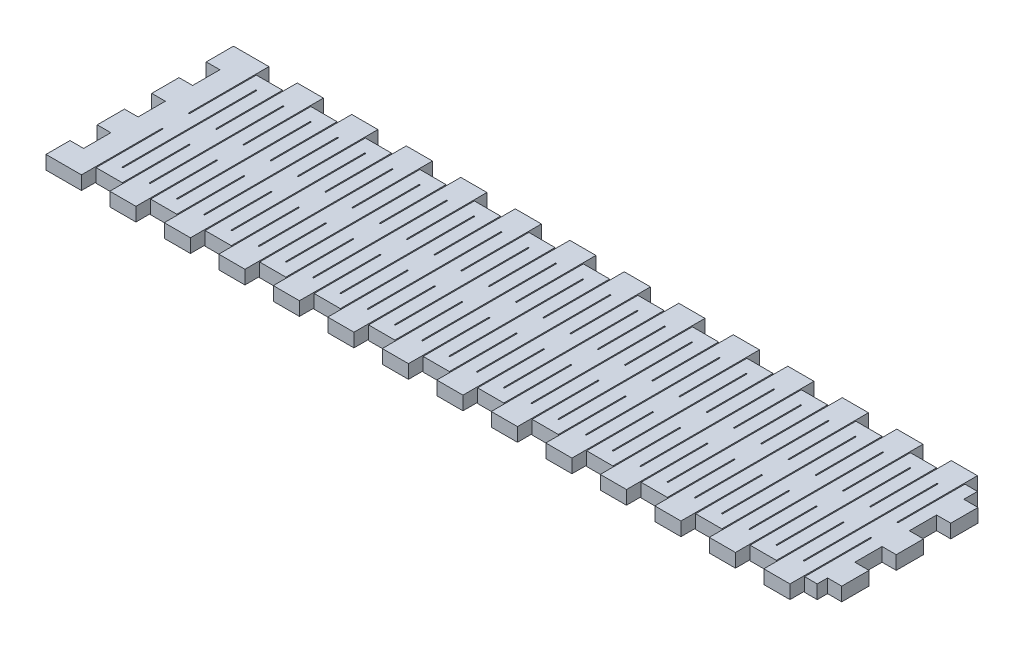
from build123d import *

# Parameters (mm, degrees)
SKETCH1_W           = 179.832
SKETCH1_H           = 43.688
BODY_DEPTH          = 3.175
SLOTS_DEPTH         = 3.175
SKETCH4_W           = 6.35
SKETCH4_H           = 3.175
TEETH_DEPTH         = 3.175
TEETH_PATTERN_COUNT = 14
TEETH_PATTERN_PITCH = 12.7
SLOTS_PATTERN_COUNT = 69
SLOTS_PATTERN_PITCH = 6.35
SKETCH5_W           = 3.175
SKETCH5_H           = 6.35
CUT_EXTRUDE3_DEPTH  = 3.175
SKETCH7_W           = 4.420803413
SKETCH7_H           = 37.338
BOSS_EXTRUDE1_DEPTH = 3.175
SKETCH6_W           = 3.302
SKETCH6_H           = 6.35
SKETCH6_H_2         = 5.588
CUT_EXTRUDE4_DEPTH  = 3.175


with BuildPart() as part:
    # Sketch1 → body (new body)
    with BuildSketch(Plane(origin=(0, 0, 0), x_dir=(1, 0, 0), z_dir=(0, 1, 0))):
        with Locations((89.916, 21.844)):
            Rectangle(SKETCH1_W, SKETCH1_H)
    extrude(amount=BODY_DEPTH)

    # Sketch2 → slots (cut)
    with BuildSketch(Plane(origin=(0, 3.175, 0), x_dir=(1, 0, 0), z_dir=(0, 1, 0))):
        with BuildLine():
            Line((8.509, 43.688), (8.509, 25.019))
            ThreePointArc((8.509, 25.019), (8.382, 24.892), (8.255, 25.019))
            Line((8.255, 25.019), (8.255, 43.688))
            ThreePointArc((8.255, 43.688), (8.382, 43.815), (8.509, 43.688))
        make_face()
        with BuildLine():
            Line((8.509, 0), (8.509, 18.669))
            ThreePointArc((8.509, 18.669), (8.382, 18.796), (8.255, 18.669))
            Line((8.255, 18.669), (8.255, 0))
            ThreePointArc((8.255, 0), (8.382, -0.127), (8.509, 0))
        make_face()
        with BuildLine():
            Line((11.684, 37.338), (11.684, 6.35))
            ThreePointArc((11.684, 6.35), (11.557, 6.223), (11.43, 6.35))
            Line((11.43, 6.35), (11.43, 37.338))
            ThreePointArc((11.43, 37.338), (11.557, 37.465), (11.684, 37.338))
        make_face()
    slots = extrude(amount=-SLOTS_DEPTH, mode=Mode.SUBTRACT)

    # Sketch4 → teeth (cut)
    with BuildSketch(Plane(origin=(0, 3.175, 0), x_dir=(1, 0, 0), z_dir=(0, 1, 0))):
        with Locations((11.557, 42.1005)):
            Rectangle(SKETCH4_W, SKETCH4_H)
        with Locations((11.557, 1.5875)):
            Rectangle(SKETCH4_W, SKETCH4_H)
    teeth = extrude(amount=-TEETH_DEPTH, mode=Mode.SUBTRACT)

    # teeth pattern: teeth ×14
    with Locations(*[(i * TEETH_PATTERN_PITCH, 0, 0) for i in range(1, TEETH_PATTERN_COUNT)]):
        add(teeth, mode=Mode.SUBTRACT)

    # slots pattern: slots ×69
    with Locations(*[(i * SLOTS_PATTERN_PITCH, 0, 0) for i in range(1, SLOTS_PATTERN_COUNT)]):
        add(slots, mode=Mode.SUBTRACT)

    # Sketch5 → Cut-Extrude3 (cut)
    with BuildSketch(Plane(origin=(0, 3.175, 0), x_dir=(1, 0, 0), z_dir=(0, 1, 0))):
        with Locations((1.5875, 34.163)):
            Rectangle(SKETCH5_W, SKETCH5_H)
        with Locations((1.5875, 21.463)):
            Rectangle(SKETCH5_W, SKETCH5_H)
        with Locations((1.5875, 8.763)):
            Rectangle(SKETCH5_W, SKETCH5_H)
    extrude(amount=-CUT_EXTRUDE3_DEPTH, mode=Mode.SUBTRACT)

    # Sketch7 → Boss-Extrude1 (add)
    with BuildSketch(Plane(origin=(0, 3.175, 0), x_dir=(1, 0, 0), z_dir=(0, 1, 0))):
        with Locations((177.621598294, 21.844)):
            Rectangle(SKETCH7_W, SKETCH7_H)
    extrude(amount=-BOSS_EXTRUDE1_DEPTH)

    # Sketch6 → Cut-Extrude4 (cut)
    with BuildSketch(Plane(origin=(0, 3.175, 0), x_dir=(1, 0, 0), z_dir=(0, 1, 0))):
        with Locations((178.181, 40.513)):
            Rectangle(SKETCH6_W, SKETCH6_H)
        with Locations((178.181, 27.813)):
            Rectangle(SKETCH6_W, SKETCH6_H)
        with Locations((178.181, 15.113)):
            Rectangle(SKETCH6_W, SKETCH6_H)
        with Locations((178.181, 2.794)):
            Rectangle(SKETCH6_W, SKETCH6_H_2)
    extrude(amount=-CUT_EXTRUDE4_DEPTH, mode=Mode.SUBTRACT)


solid = part.part
